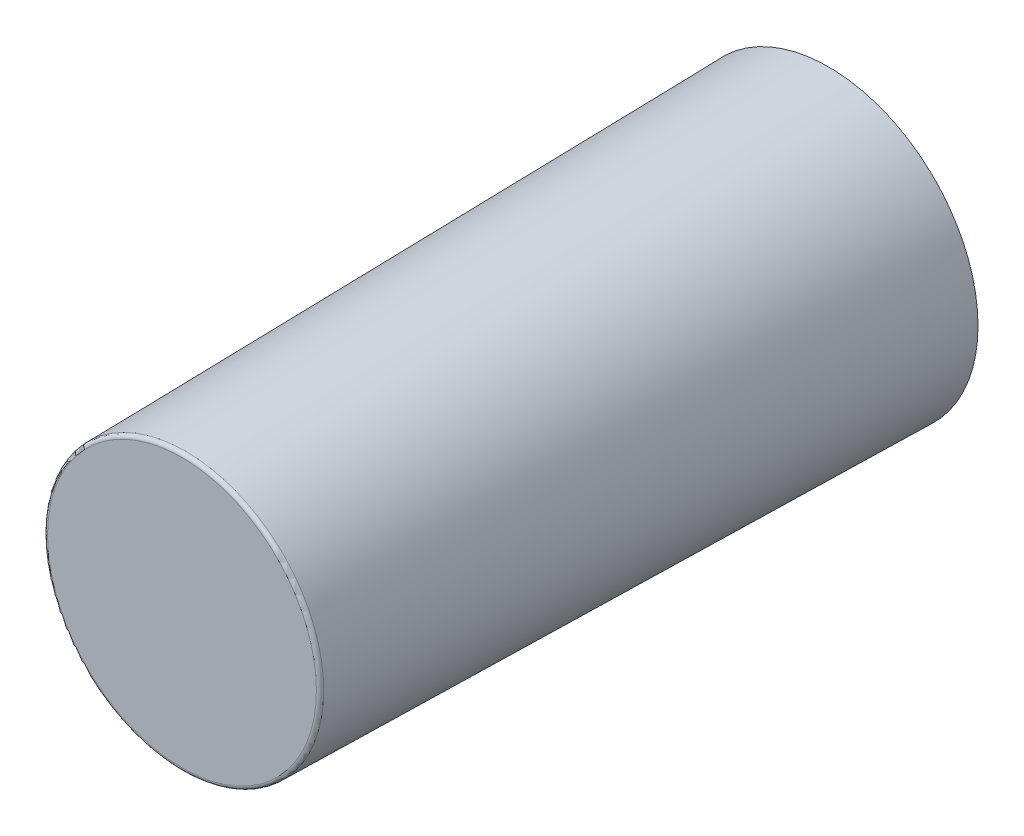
from build123d import *

# Parameters (mm, degrees)
SKETCH1_R           = 7.8613
BOSS_EXTRUDE1_DEPTH = 27.4574
SKETCH2_R           = 20.193
BOSS_EXTRUDE2_DEPTH = 87.4395
DRAFT4_ANGLE        = -1
FILLET1_R           = 0.5
SKETCH3_R           = 7.8613
CUT_EXTRUDE1_DEPTH  = 27.4574


with BuildPart() as part:
    # Sketch1 → Boss-Extrude1 (new body)
    with BuildSketch(Plane.XY):
        Circle(SKETCH1_R)
    extrude(amount=BOSS_EXTRUDE1_DEPTH)

    # Sketch2 → Boss-Extrude2 (add)
    with BuildSketch(Plane.XY.offset(27.4574)):
        Circle(SKETCH2_R)
    extrude(amount=BOSS_EXTRUDE2_DEPTH)

    # Draft4
    draft4_faces = [part.faces().sort_by_distance(p)[0] for p in [
        (-20.193, 0, 71.17715),
    ]]
    draft(draft4_faces, Plane(origin=(0, 0, 27.4574), x_dir=(-1, 0, 0), z_dir=(0, 0, -1)), DRAFT4_ANGLE)

    # Fillet1
    fillet1_edges = [part.edges().sort_by_distance(p)[0] for p in [
        (-18.66673785, 0, 114.8969),
    ]]
    fillet(fillet1_edges, radius=FILLET1_R)

    # Sketch3 → Cut-Extrude1 (cut)
    with BuildSketch(Plane(origin=(0, 0, 0), x_dir=(-1, 0, 0), z_dir=(0, 0, -1))):
        Circle(SKETCH3_R)
    extrude(amount=-CUT_EXTRUDE1_DEPTH, mode=Mode.SUBTRACT)


solid = part.part
